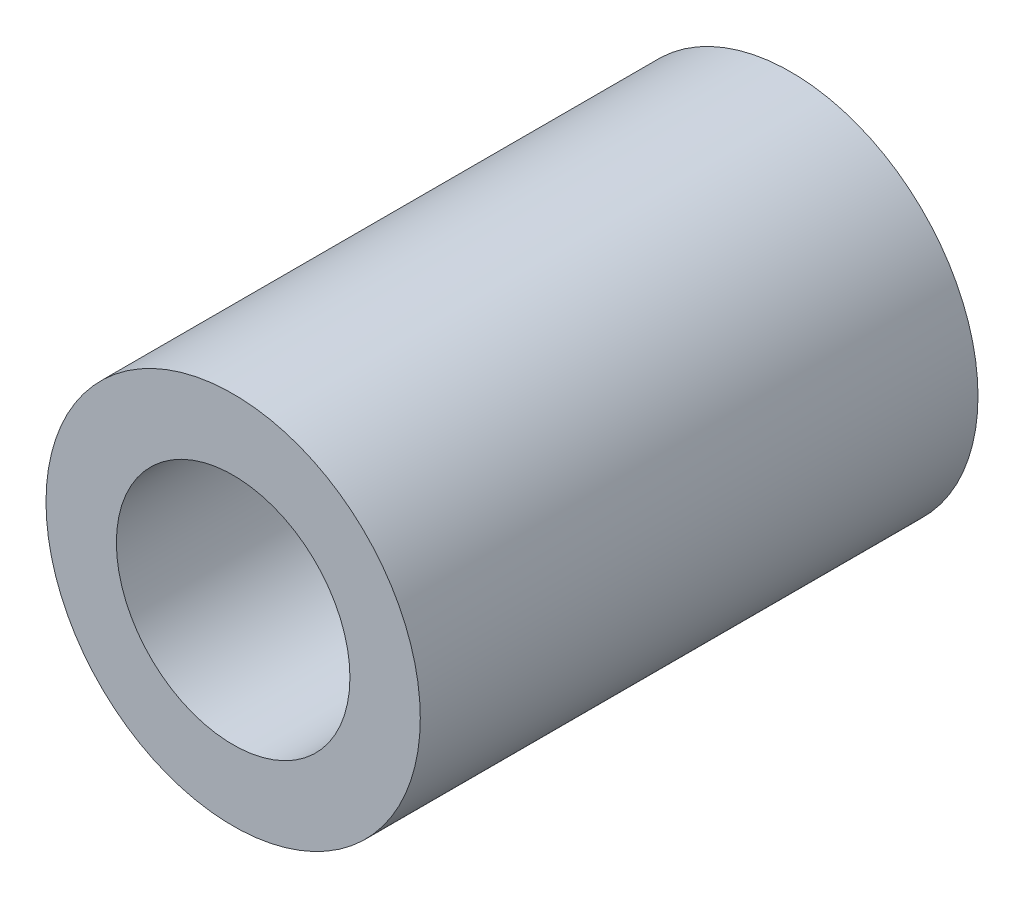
ISO-10303-21;
HEADER;
FILE_DESCRIPTION(('STEP AP214'),'2;1');
FILE_NAME('part.step','',(''),(''),'','','');
FILE_SCHEMA(('AUTOMOTIVE_DESIGN { 1 0 10303 214 1 1 1 1 }'));
ENDSEC;
DATA;
#1=APPLICATION_CONTEXT('core data for automotive mechanical design processes');
#2=APPLICATION_PROTOCOL_DEFINITION('international standard','automotive_design',2000,#1);
#3=PRODUCT_CONTEXT('',#1,'mechanical');
#4=PRODUCT('Part','Part','',(#3));
#5=PRODUCT_RELATED_PRODUCT_CATEGORY('part','',(#4));
#6=PRODUCT_DEFINITION_FORMATION('','',#4);
#7=PRODUCT_DEFINITION_CONTEXT('part definition',#1,'design');
#8=PRODUCT_DEFINITION('design','',#6,#7);
#9=PRODUCT_DEFINITION_SHAPE('','',#8);
#10=(LENGTH_UNIT() NAMED_UNIT(*) SI_UNIT(.MILLI.,.METRE.));
#11=(NAMED_UNIT(*) PLANE_ANGLE_UNIT() SI_UNIT($,.RADIAN.));
#12=(NAMED_UNIT(*) SI_UNIT($,.STERADIAN.) SOLID_ANGLE_UNIT());
#13=UNCERTAINTY_MEASURE_WITH_UNIT(LENGTH_MEASURE(1.E-05),#10,'distance_accuracy_value','');
#14=(GEOMETRIC_REPRESENTATION_CONTEXT(3) GLOBAL_UNCERTAINTY_ASSIGNED_CONTEXT((#13)) GLOBAL_UNIT_ASSIGNED_CONTEXT((#10,
#11,#12)) REPRESENTATION_CONTEXT('',''));
#15=CARTESIAN_POINT('',(0.,0.,0.));
#16=DIRECTION('',(0.,0.,1.));
#17=DIRECTION('',(1.,0.,0.));
#18=AXIS2_PLACEMENT_3D('',#15,#16,#17);
#19=CARTESIAN_POINT('',(0.,0.,9.4615));
#20=DIRECTION('',(0.,0.,1.));
#21=DIRECTION('',(1.,0.,0.));
#22=AXIS2_PLACEMENT_3D('',#19,#20,#21);
#23=PLANE('',#22);
#24=CARTESIAN_POINT('',(0.,0.,9.4615));
#25=DIRECTION('',(0.,0.,1.));
#26=DIRECTION('',(1.,0.,0.));
#27=AXIS2_PLACEMENT_3D('',#24,#25,#26);
#28=CIRCLE('',#27,6.35);
#29=CARTESIAN_POINT('',(6.35,0.,9.4615));
#30=VERTEX_POINT('',#29);
#31=EDGE_CURVE('E10',#30,#30,#28,.T.);
#32=ORIENTED_EDGE('',*,*,#31,.T.);
#33=EDGE_LOOP('',(#32));
#34=FACE_BOUND('',#33,.T.);
#35=CARTESIAN_POINT('',(0.,0.,9.4615));
#36=DIRECTION('',(0.,0.,1.));
#37=DIRECTION('',(1.,0.,0.));
#38=AXIS2_PLACEMENT_3D('',#35,#36,#37);
#39=CIRCLE('',#38,3.9624);
#40=CARTESIAN_POINT('',(3.9624,0.,9.4615));
#41=VERTEX_POINT('',#40);
#42=EDGE_CURVE('E42',#41,#41,#39,.T.);
#43=ORIENTED_EDGE('',*,*,#42,.F.);
#44=EDGE_LOOP('',(#43));
#45=FACE_BOUND('',#44,.T.);
#46=ADVANCED_FACE('F31',(#34,#45),#23,.T.);
#47=CARTESIAN_POINT('',(0.,0.,-9.4615));
#48=DIRECTION('',(0.,0.,1.));
#49=DIRECTION('',(1.,0.,0.));
#50=AXIS2_PLACEMENT_3D('',#47,#48,#49);
#51=PLANE('',#50);
#52=CARTESIAN_POINT('',(0.,0.,-9.4615));
#53=DIRECTION('',(0.,0.,1.));
#54=DIRECTION('',(1.,0.,0.));
#55=AXIS2_PLACEMENT_3D('',#52,#53,#54);
#56=CIRCLE('',#55,6.35);
#57=CARTESIAN_POINT('',(6.35,0.,-9.4615));
#58=VERTEX_POINT('',#57);
#59=EDGE_CURVE('E35',#58,#58,#56,.T.);
#60=ORIENTED_EDGE('',*,*,#59,.F.);
#61=EDGE_LOOP('',(#60));
#62=FACE_BOUND('',#61,.T.);
#63=CARTESIAN_POINT('',(0.,0.,-9.4615));
#64=DIRECTION('',(0.,0.,1.));
#65=DIRECTION('',(1.,0.,0.));
#66=AXIS2_PLACEMENT_3D('',#63,#64,#65);
#67=CIRCLE('',#66,3.9624);
#68=CARTESIAN_POINT('',(3.9624,0.,-9.4615));
#69=VERTEX_POINT('',#68);
#70=EDGE_CURVE('E44',#69,#69,#67,.T.);
#71=ORIENTED_EDGE('',*,*,#70,.T.);
#72=EDGE_LOOP('',(#71));
#73=FACE_BOUND('',#72,.T.);
#74=ADVANCED_FACE('F54',(#62,#73),#51,.F.);
#75=CARTESIAN_POINT('',(0.,0.,9.4615));
#76=DIRECTION('',(0.,0.,-1.));
#77=DIRECTION('',(-1.,0.,0.));
#78=AXIS2_PLACEMENT_3D('',#75,#76,#77);
#79=CYLINDRICAL_SURFACE('',#78,6.35);
#80=ORIENTED_EDGE('',*,*,#31,.F.);
#81=EDGE_LOOP('',(#80));
#82=FACE_BOUND('',#81,.T.);
#83=ORIENTED_EDGE('',*,*,#59,.T.);
#84=EDGE_LOOP('',(#83));
#85=FACE_BOUND('',#84,.T.);
#86=ADVANCED_FACE('F33',(#82,#85),#79,.T.);
#87=CARTESIAN_POINT('',(0.,0.,9.4615));
#88=DIRECTION('',(0.,0.,-1.));
#89=DIRECTION('',(-1.,0.,0.));
#90=AXIS2_PLACEMENT_3D('',#87,#88,#89);
#91=CYLINDRICAL_SURFACE('',#90,3.9624);
#92=ORIENTED_EDGE('',*,*,#42,.T.);
#93=EDGE_LOOP('',(#92));
#94=FACE_BOUND('',#93,.T.);
#95=ORIENTED_EDGE('',*,*,#70,.F.);
#96=EDGE_LOOP('',(#95));
#97=FACE_BOUND('',#96,.T.);
#98=ADVANCED_FACE('F50',(#94,#97),#91,.F.);
#99=CLOSED_SHELL('',(#46,#74,#86,#98));
#100=MANIFOLD_SOLID_BREP('B2',#99);
#101=ADVANCED_BREP_SHAPE_REPRESENTATION('',(#18,#100),#14);
#102=SHAPE_DEFINITION_REPRESENTATION(#9,#101);
ENDSEC;
END-ISO-10303-21;
